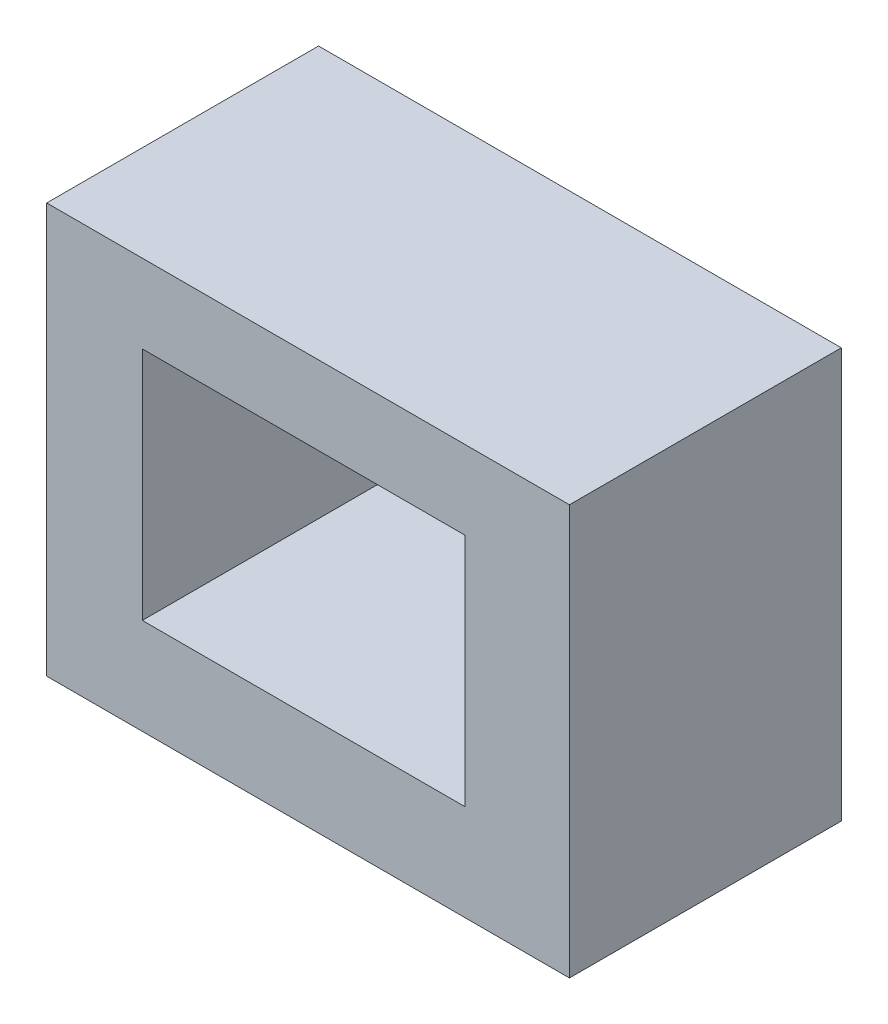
from build123d import *

# Parameters (mm, degrees)
SKETCH1_W          = 97.686479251
SKETCH1_H          = 76.583476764
EXTRUDE1_DEPTH     = 50.8
SKETCH2_W          = 60.317726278
SKETCH2_H          = 43.94187299
CUT_EXTRUDE1_DEPTH = 89.513023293


with BuildPart() as part:
    # Sketch1 → Extrude1 (new body)
    with BuildSketch(Plane.XY):
        with Locations((8.541074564, -5.990941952)):
            Rectangle(SKETCH1_W, SKETCH1_H)
    extrude(amount=EXTRUDE1_DEPTH)

    # Sketch2 → Cut-Extrude1 (cut, through all)
    with BuildSketch(Plane.XY.offset(50.8)):
        with Locations((7.722281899, -4.353356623)):
            Rectangle(SKETCH2_W, SKETCH2_H)
    extrude(amount=-CUT_EXTRUDE1_DEPTH, mode=Mode.SUBTRACT)


solid = part.part
